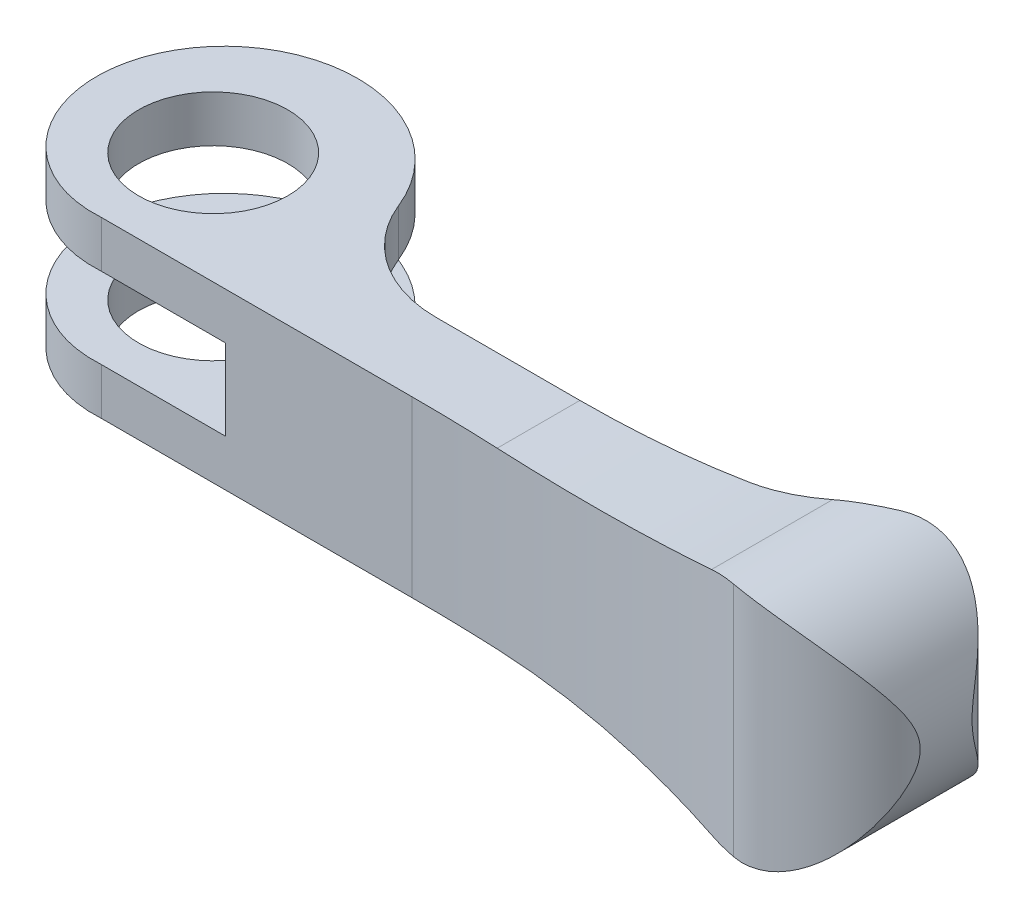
ISO-10303-21;
HEADER;
FILE_DESCRIPTION(('STEP AP214'),'2;1');
FILE_NAME('part.step','',(''),(''),'','','');
FILE_SCHEMA(('AUTOMOTIVE_DESIGN { 1 0 10303 214 1 1 1 1 }'));
ENDSEC;
DATA;
#1=APPLICATION_CONTEXT('core data for automotive mechanical design processes');
#2=APPLICATION_PROTOCOL_DEFINITION('international standard','automotive_design',2000,#1);
#3=PRODUCT_CONTEXT('',#1,'mechanical');
#4=PRODUCT('Part','Part','',(#3));
#5=PRODUCT_RELATED_PRODUCT_CATEGORY('part','',(#4));
#6=PRODUCT_DEFINITION_FORMATION('','',#4);
#7=PRODUCT_DEFINITION_CONTEXT('part definition',#1,'design');
#8=PRODUCT_DEFINITION('design','',#6,#7);
#9=PRODUCT_DEFINITION_SHAPE('','',#8);
#10=(LENGTH_UNIT() NAMED_UNIT(*) SI_UNIT(.MILLI.,.METRE.));
#11=(NAMED_UNIT(*) PLANE_ANGLE_UNIT() SI_UNIT($,.RADIAN.));
#12=(NAMED_UNIT(*) SI_UNIT($,.STERADIAN.) SOLID_ANGLE_UNIT());
#13=UNCERTAINTY_MEASURE_WITH_UNIT(LENGTH_MEASURE(1.E-05),#10,'distance_accuracy_value','');
#14=(GEOMETRIC_REPRESENTATION_CONTEXT(3) GLOBAL_UNCERTAINTY_ASSIGNED_CONTEXT((#13)) GLOBAL_UNIT_ASSIGNED_CONTEXT((#10,
#11,#12)) REPRESENTATION_CONTEXT('',''));
#15=CARTESIAN_POINT('',(0.,0.,0.));
#16=DIRECTION('',(0.,0.,1.));
#17=DIRECTION('',(1.,0.,0.));
#18=AXIS2_PLACEMENT_3D('',#15,#16,#17);
#19=CARTESIAN_POINT('',(25.,-9.5,165.511363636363));
#20=DIRECTION('',(0.,1.,0.));
#21=DIRECTION('',(1.,0.,0.));
#22=AXIS2_PLACEMENT_3D('',#19,#20,#21);
#23=CYLINDRICAL_SURFACE('',#22,156.511363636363);
#24=CARTESIAN_POINT('',(51.3201707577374,9.24653148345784,11.2289746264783));
#25=CARTESIAN_POINT('',(51.4954696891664,9.2878649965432,11.258877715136));
#26=CARTESIAN_POINT('',(51.6718456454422,9.32417702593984,11.2892762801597));
#27=CARTESIAN_POINT('',(52.0256660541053,9.38661054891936,11.3508882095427));
#28=CARTESIAN_POINT('',(52.203105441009,9.41276355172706,11.3820987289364));
#29=CARTESIAN_POINT('',(52.7374701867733,9.476153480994,11.4770445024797));
#30=CARTESIAN_POINT('',(53.0960294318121,9.49822441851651,11.5420236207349));
#31=CARTESIAN_POINT('',(53.4546518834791,9.49989176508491,11.608343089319));
#32=B_SPLINE_CURVE_WITH_KNOTS('',3,(#24,#25,#26,#27,#28,#29,#30,#31),.UNSPECIFIED.,.F.,.F.,(4,2,
2,4),(0.,0.547600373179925,1.0934884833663,2.18654613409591),.UNSPECIFIED.);
#33=CARTESIAN_POINT('',(51.3201707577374,9.24653148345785,11.2289746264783));
#34=VERTEX_POINT('',#33);
#35=CARTESIAN_POINT('',(53.4546518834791,9.49989176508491,11.6083430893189));
#36=VERTEX_POINT('',#35);
#37=EDGE_CURVE('E179',#34,#36,#32,.T.);
#38=ORIENTED_EDGE('',*,*,#37,.F.);
#39=CARTESIAN_POINT('',(32.,7.,9.15661651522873));
#40=CARTESIAN_POINT('',(32.8182704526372,6.99999719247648,9.19324583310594));
#41=CARTESIAN_POINT('',(33.6361960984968,7.01192923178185,9.23630636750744));
#42=CARTESIAN_POINT('',(35.2705716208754,7.05957160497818,9.33520563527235));
#43=CARTESIAN_POINT('',(36.0870215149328,7.09528165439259,9.39104421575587));
#44=CARTESIAN_POINT('',(38.5259507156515,7.23753055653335,9.57706397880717));
#45=CARTESIAN_POINT('',(40.1451052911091,7.37919060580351,9.72606814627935));
#46=CARTESIAN_POINT('',(43.3672677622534,7.75507082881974,10.0730278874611));
#47=CARTESIAN_POINT('',(44.9702760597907,7.98928869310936,10.2709822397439));
#48=CARTESIAN_POINT('',(47.3611114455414,8.40908803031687,10.6035220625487));
#49=CARTESIAN_POINT('',(48.1574841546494,8.56083603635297,10.7205953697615));
#50=CARTESIAN_POINT('',(49.7438041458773,8.88685979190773,10.9662394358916));
#51=CARTESIAN_POINT('',(50.5337515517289,9.06113510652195,11.0948099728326));
#52=CARTESIAN_POINT('',(51.3201707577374,9.24653148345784,11.2289746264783));
#53=B_SPLINE_CURVE_WITH_KNOTS('',3,(#39,#40,#41,#42,#43,#44,#45,#46,#47,#48,#49,#50,#51,#52),
.UNSPECIFIED.,.F.,.F.,(4,2,2,2,2,2,4),(0.,2.45704528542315,4.91406117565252,9.80682643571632,
14.699469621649,17.1564399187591,19.6133627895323),.UNSPECIFIED.);
#54=CARTESIAN_POINT('',(32.,7.,9.15661651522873));
#55=VERTEX_POINT('',#54);
#56=EDGE_CURVE('E145',#55,#34,#53,.T.);
#57=ORIENTED_EDGE('',*,*,#56,.F.);
#58=CARTESIAN_POINT('',(25.,7.,165.511363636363));
#59=DIRECTION('',(0.,1.,0.));
#60=DIRECTION('',(1.,0.,0.));
#61=AXIS2_PLACEMENT_3D('',#58,#59,#60);
#62=CIRCLE('',#61,156.511363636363);
#63=CARTESIAN_POINT('',(25.,7.,9.));
#64=VERTEX_POINT('',#63);
#65=EDGE_CURVE('E154',#64,#55,#62,.F.);
#66=ORIENTED_EDGE('',*,*,#65,.F.);
#67=DIRECTION('',(0.,1.,0.));
#68=VECTOR('',#67,1.);
#69=CARTESIAN_POINT('',(25.,-9.5,9.));
#70=LINE('',#69,#68);
#71=CARTESIAN_POINT('',(25.,-7.,9.));
#72=VERTEX_POINT('',#71);
#73=EDGE_CURVE('E303',#72,#64,#70,.T.);
#74=ORIENTED_EDGE('',*,*,#73,.F.);
#75=CARTESIAN_POINT('',(25.,-7.,165.511363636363));
#76=DIRECTION('',(0.,1.,0.));
#77=DIRECTION('',(1.,0.,0.));
#78=AXIS2_PLACEMENT_3D('',#75,#76,#77);
#79=CIRCLE('',#78,156.511363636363);
#80=CARTESIAN_POINT('',(32.,-7.,9.15661651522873));
#81=VERTEX_POINT('',#80);
#82=EDGE_CURVE('E558',#72,#81,#79,.F.);
#83=ORIENTED_EDGE('',*,*,#82,.T.);
#84=CARTESIAN_POINT('',(32.,-7.,9.15661651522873));
#85=CARTESIAN_POINT('',(32.8182704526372,-6.99999719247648,9.19324583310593));
#86=CARTESIAN_POINT('',(33.6361960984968,-7.01192923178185,9.23630636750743));
#87=CARTESIAN_POINT('',(35.2705716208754,-7.05957160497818,9.33520563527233));
#88=CARTESIAN_POINT('',(36.0870215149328,-7.09528165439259,9.39104421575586));
#89=CARTESIAN_POINT('',(38.5259507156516,-7.23753055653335,9.57706397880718));
#90=CARTESIAN_POINT('',(40.1451052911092,-7.37919060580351,9.72606814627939));
#91=CARTESIAN_POINT('',(43.3672677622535,-7.75507082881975,10.0730278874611));
#92=CARTESIAN_POINT('',(44.9702760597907,-7.98928869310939,10.2709822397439));
#93=CARTESIAN_POINT('',(47.3611114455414,-8.40908803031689,10.6035220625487));
#94=CARTESIAN_POINT('',(48.1574841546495,-8.56083603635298,10.7205953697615));
#95=CARTESIAN_POINT('',(49.7438041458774,-8.88685979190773,10.9662394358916));
#96=CARTESIAN_POINT('',(50.533751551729,-9.06113510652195,11.0948099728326));
#97=CARTESIAN_POINT('',(51.3201707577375,-9.24653148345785,11.2289746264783));
#98=B_SPLINE_CURVE_WITH_KNOTS('',3,(#84,#85,#86,#87,#88,#89,#90,#91,#92,#93,#94,#95,#96,#97),
.UNSPECIFIED.,.F.,.F.,(4,2,2,2,2,2,4),(0.,2.45704528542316,4.91406117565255,9.80682643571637,
14.699469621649,17.1564399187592,19.6133627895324),.UNSPECIFIED.);
#99=CARTESIAN_POINT('',(51.3201707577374,-9.24653148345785,11.2289746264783));
#100=VERTEX_POINT('',#99);
#101=EDGE_CURVE('E541',#81,#100,#98,.T.);
#102=ORIENTED_EDGE('',*,*,#101,.T.);
#103=CARTESIAN_POINT('',(51.3201707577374,-9.24653148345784,11.2289746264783));
#104=CARTESIAN_POINT('',(51.4954696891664,-9.2878649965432,11.258877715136));
#105=CARTESIAN_POINT('',(51.6718456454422,-9.32417702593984,11.2892762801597));
#106=CARTESIAN_POINT('',(52.0256660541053,-9.38661054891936,11.3508882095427));
#107=CARTESIAN_POINT('',(52.203105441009,-9.41276355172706,11.3820987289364));
#108=CARTESIAN_POINT('',(52.7374701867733,-9.476153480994,11.4770445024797));
#109=CARTESIAN_POINT('',(53.0960294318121,-9.49822441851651,11.5420236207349));
#110=CARTESIAN_POINT('',(53.4546518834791,-9.49989176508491,11.608343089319));
#111=B_SPLINE_CURVE_WITH_KNOTS('',3,(#103,#104,#105,#106,#107,#108,#109,#110),.UNSPECIFIED.,.F.,
.F.,(4,2,2,4),(0.,0.547600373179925,1.0934884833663,2.18654613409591),.UNSPECIFIED.);
#112=CARTESIAN_POINT('',(53.4546518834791,-9.49989176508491,11.6083430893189));
#113=VERTEX_POINT('',#112);
#114=EDGE_CURVE('E222',#100,#113,#111,.T.);
#115=ORIENTED_EDGE('',*,*,#114,.T.);
#116=DIRECTION('',(0.,1.,0.));
#117=VECTOR('',#116,1.);
#118=CARTESIAN_POINT('',(53.4546518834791,-9.5,11.6083430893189));
#119=LINE('',#118,#117);
#120=EDGE_CURVE('E286',#113,#36,#119,.T.);
#121=ORIENTED_EDGE('',*,*,#120,.T.);
#122=EDGE_LOOP('',(#38,#57,#66,#74,#83,#102,#115,#121));
#123=FACE_BOUND('',#122,.T.);
#124=ADVANCED_FACE('F14',(#123),#23,.F.);
#125=CARTESIAN_POINT('',(0.,-9.5,9.));
#126=DIRECTION('',(0.,0.,-1.));
#127=DIRECTION('',(1.,0.,0.));
#128=AXIS2_PLACEMENT_3D('',#125,#126,#127);
#129=PLANE('',#128);
#130=DIRECTION('',(1.,0.,0.));
#131=VECTOR('',#130,1.);
#132=CARTESIAN_POINT('',(0.,7.,9.));
#133=LINE('',#132,#131);
#134=CARTESIAN_POINT('',(0.,7.,9.));
#135=VERTEX_POINT('',#134);
#136=EDGE_CURVE('E164',#135,#64,#133,.T.);
#137=ORIENTED_EDGE('',*,*,#136,.F.);
#138=DIRECTION('',(0.,1.,0.));
#139=VECTOR('',#138,1.);
#140=CARTESIAN_POINT('',(0.,-9.5,9.));
#141=LINE('',#140,#139);
#142=CARTESIAN_POINT('',(0.,3.25,9.));
#143=VERTEX_POINT('',#142);
#144=EDGE_CURVE('E294',#143,#135,#141,.T.);
#145=ORIENTED_EDGE('',*,*,#144,.F.);
#146=DIRECTION('',(1.,0.,0.));
#147=VECTOR('',#146,1.);
#148=CARTESIAN_POINT('',(0.,3.25,9.));
#149=LINE('',#148,#147);
#150=CARTESIAN_POINT('',(10.,3.25,9.));
#151=VERTEX_POINT('',#150);
#152=EDGE_CURVE('E42',#143,#151,#149,.T.);
#153=ORIENTED_EDGE('',*,*,#152,.T.);
#154=DIRECTION('',(0.,-1.,0.));
#155=VECTOR('',#154,1.);
#156=CARTESIAN_POINT('',(10.,-9.5,9.));
#157=LINE('',#156,#155);
#158=CARTESIAN_POINT('',(10.,-3.25,9.));
#159=VERTEX_POINT('',#158);
#160=EDGE_CURVE('E367',#151,#159,#157,.T.);
#161=ORIENTED_EDGE('',*,*,#160,.T.);
#162=DIRECTION('',(-1.,0.,0.));
#163=VECTOR('',#162,1.);
#164=CARTESIAN_POINT('',(0.,-3.25,9.));
#165=LINE('',#164,#163);
#166=CARTESIAN_POINT('',(0.,-3.25,9.));
#167=VERTEX_POINT('',#166);
#168=EDGE_CURVE('E361',#159,#167,#165,.T.);
#169=ORIENTED_EDGE('',*,*,#168,.T.);
#170=CARTESIAN_POINT('',(0.,-7.,9.));
#171=VERTEX_POINT('',#170);
#172=EDGE_CURVE('E298',#171,#167,#141,.T.);
#173=ORIENTED_EDGE('',*,*,#172,.F.);
#174=DIRECTION('',(1.,0.,0.));
#175=VECTOR('',#174,1.);
#176=CARTESIAN_POINT('',(0.,-7.,9.));
#177=LINE('',#176,#175);
#178=EDGE_CURVE('E543',#171,#72,#177,.T.);
#179=ORIENTED_EDGE('',*,*,#178,.T.);
#180=ORIENTED_EDGE('',*,*,#73,.T.);
#181=EDGE_LOOP('',(#137,#145,#153,#161,#169,#173,#179,#180));
#182=FACE_BOUND('',#181,.T.);
#183=ADVANCED_FACE('F274',(#182),#129,.F.);
#184=CARTESIAN_POINT('',(0.,-9.5,9.));
#185=CARTESIAN_POINT('',(-1.17809724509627,-9.5,9.082375));
#186=CARTESIAN_POINT('',(-2.38889185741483,-9.5,8.93034251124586));
#187=CARTESIAN_POINT('',(-4.68855121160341,-9.5,8.15611653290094));
#188=CARTESIAN_POINT('',(-5.77641227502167,-9.5,7.53398899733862));
#189=CARTESIAN_POINT('',(-7.65048483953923,-9.5,5.892908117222));
#190=CARTESIAN_POINT('',(-8.43577630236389,-9.5,4.87441779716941));
#191=CARTESIAN_POINT('',(-9.56393765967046,-9.5,2.58130784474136));
#192=CARTESIAN_POINT('',(-9.906125,-9.5,1.3074915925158));
#193=CARTESIAN_POINT('',(-10.070875,-9.5,-1.30749159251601));
#194=CARTESIAN_POINT('',(-9.89311450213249,-9.5,-2.64762964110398));
#195=CARTESIAN_POINT('',(-9.01985437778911,-9.5,-5.18637857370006));
#196=CARTESIAN_POINT('',(-8.32445967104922,-9.5,-6.38389170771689));
#197=CARTESIAN_POINT('',(-6.50038754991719,-9.5,-8.44095551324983));
#198=CARTESIAN_POINT('',(-5.37224515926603,-9.5,-9.29951414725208));
#199=CARTESIAN_POINT('',(-2.8400456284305,-9.5,-10.5267096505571));
#200=CARTESIAN_POINT('',(-1.43688593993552,-9.5,-10.894625));
#201=CARTESIAN_POINT('',(1.43688593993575,-9.5,-11.059375));
#202=CARTESIAN_POINT('',(2.90636742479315,-9.5,-10.8558864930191));
#203=CARTESIAN_POINT('',(5.6842059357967,-9.5,-9.88359222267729));
#204=CARTESIAN_POINT('',(6.9913711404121,-9.5,-9.11493034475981));
#205=CARTESIAN_POINT('',(9.23142618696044,-9.5,-7.10786698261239));
#206=CARTESIAN_POINT('',(10.1632519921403,-9.5,-5.87007252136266));
#207=CARTESIAN_POINT('',(11.4894816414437,-9.5,-3.09878341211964));
#208=CARTESIAN_POINT('',(11.883125,-9.5,-1.56628028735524));
#209=CARTESIAN_POINT('',(12.047875,-9.5,1.56628028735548));
#210=CARTESIAN_POINT('',(11.8186584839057,-9.5,3.16510520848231));
#211=CARTESIAN_POINT('',(10.7473300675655,-9.5,6.18203329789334));
#212=CARTESIAN_POINT('',(9.9054010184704,-9.5,7.59885057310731));
#213=CARTESIAN_POINT('',(7.71534641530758,-9.5,10.021896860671));
#214=CARTESIAN_POINT('',(6.36789988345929,-9.5,11.0269898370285));
#215=CARTESIAN_POINT('',(3.35752119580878,-9.5,12.4522536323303));
#216=CARTESIAN_POINT('',(1.69567463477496,-9.5,12.871625));
#217=CARTESIAN_POINT('',(-1.32513132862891E-13,-9.5,12.954));
#218=B_SPLINE_CURVE_WITH_KNOTS('',3,(#184,#185,#186,#187,#188,#189,#190,#191,#192,#193,#194,
#195,#196,#197,#198,#199,#200,#201,#202,#203,#204,#205,#206,#207,#208,#209,#210,#211,#212,#213,
#214,#215,#216,#217),.UNSPECIFIED.,.F.,.F.,(4,2,2,2,2,2,2,2,2,2,2,2,2,2,2,2,4),(0.,0.0625,0.125,
0.1875,0.25,0.3125,0.375,0.4375,0.5,0.5625,0.625,0.6875,0.75,0.8125,0.875,0.9375,1.),.UNSPECIFIED.);
#219=DIRECTION('',(0.,1.,0.));
#220=VECTOR('',#219,1.);
#221=SURFACE_OF_LINEAR_EXTRUSION('',#218,#220);
#222=CARTESIAN_POINT('',(0.,7.,9.));
#223=CARTESIAN_POINT('',(-1.17809724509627,7.,9.082375));
#224=CARTESIAN_POINT('',(-2.38889185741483,7.,8.93034251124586));
#225=CARTESIAN_POINT('',(-4.68855121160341,7.,8.15611653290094));
#226=CARTESIAN_POINT('',(-5.77641227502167,7.,7.53398899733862));
#227=CARTESIAN_POINT('',(-7.65048483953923,7.,5.892908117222));
#228=CARTESIAN_POINT('',(-8.43577630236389,7.,4.87441779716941));
#229=CARTESIAN_POINT('',(-9.56393765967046,7.,2.58130784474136));
#230=CARTESIAN_POINT('',(-9.906125,7.,1.3074915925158));
#231=CARTESIAN_POINT('',(-10.070875,7.,-1.30749159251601));
#232=CARTESIAN_POINT('',(-9.89311450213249,7.,-2.64762964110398));
#233=CARTESIAN_POINT('',(-9.01985437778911,7.,-5.18637857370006));
#234=CARTESIAN_POINT('',(-8.32445967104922,7.,-6.38389170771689));
#235=CARTESIAN_POINT('',(-6.50038754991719,7.,-8.44095551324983));
#236=CARTESIAN_POINT('',(-5.37224515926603,7.,-9.29951414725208));
#237=CARTESIAN_POINT('',(-2.8400456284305,7.,-10.5267096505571));
#238=CARTESIAN_POINT('',(-1.43688593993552,7.,-10.894625));
#239=CARTESIAN_POINT('',(1.43688593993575,7.,-11.059375));
#240=CARTESIAN_POINT('',(2.90636742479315,7.,-10.8558864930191));
#241=CARTESIAN_POINT('',(5.6842059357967,7.,-9.88359222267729));
#242=CARTESIAN_POINT('',(6.9913711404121,7.,-9.11493034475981));
#243=CARTESIAN_POINT('',(9.23142618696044,7.,-7.10786698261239));
#244=CARTESIAN_POINT('',(10.1632519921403,7.,-5.87007252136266));
#245=CARTESIAN_POINT('',(11.4894816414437,7.,-3.09878341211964));
#246=CARTESIAN_POINT('',(11.883125,7.,-1.56628028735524));
#247=CARTESIAN_POINT('',(12.047875,7.,1.56628028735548));
#248=CARTESIAN_POINT('',(11.8186584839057,7.,3.16510520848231));
#249=CARTESIAN_POINT('',(10.7473300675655,7.,6.18203329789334));
#250=CARTESIAN_POINT('',(9.9054010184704,7.,7.59885057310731));
#251=CARTESIAN_POINT('',(7.71534641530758,7.,10.021896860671));
#252=CARTESIAN_POINT('',(6.36789988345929,7.,11.0269898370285));
#253=CARTESIAN_POINT('',(3.35752119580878,7.,12.4522536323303));
#254=CARTESIAN_POINT('',(1.69567463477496,7.,12.871625));
#255=CARTESIAN_POINT('',(-1.32513132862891E-13,7.,12.954));
#256=B_SPLINE_CURVE_WITH_KNOTS('',3,(#222,#223,#224,#225,#226,#227,#228,#229,#230,#231,#232,
#233,#234,#235,#236,#237,#238,#239,#240,#241,#242,#243,#244,#245,#246,#247,#248,#249,#250,#251,
#252,#253,#254,#255),.UNSPECIFIED.,.F.,.F.,(4,2,2,2,2,2,2,2,2,2,2,2,2,2,2,2,4),(0.,0.0625,0.125,
0.1875,0.25,0.3125,0.375,0.4375,0.5,0.5625,0.625,0.6875,0.75,0.8125,0.875,0.9375,1.),.UNSPECIFIED.);
#257=CARTESIAN_POINT('',(11.1333903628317,7.,-3.78460278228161));
#258=VERTEX_POINT('',#257);
#259=EDGE_CURVE('E162',#258,#135,#256,.F.);
#260=ORIENTED_EDGE('',*,*,#259,.F.);
#261=DIRECTION('',(0.,1.,0.));
#262=VECTOR('',#261,1.);
#263=CARTESIAN_POINT('',(11.1333903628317,9.5,-3.78460278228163));
#264=LINE('',#263,#262);
#265=CARTESIAN_POINT('',(11.1333903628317,3.25,-3.78460278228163));
#266=VERTEX_POINT('',#265);
#267=EDGE_CURVE('E35',#258,#266,#264,.F.);
#268=ORIENTED_EDGE('',*,*,#267,.T.);
#269=CARTESIAN_POINT('',(0.,3.25,9.));
#270=CARTESIAN_POINT('',(-1.17809724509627,3.25,9.082375));
#271=CARTESIAN_POINT('',(-2.38889185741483,3.25,8.93034251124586));
#272=CARTESIAN_POINT('',(-4.68855121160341,3.25,8.15611653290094));
#273=CARTESIAN_POINT('',(-5.77641227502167,3.25,7.53398899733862));
#274=CARTESIAN_POINT('',(-7.65048483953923,3.25,5.892908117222));
#275=CARTESIAN_POINT('',(-8.43577630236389,3.25,4.87441779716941));
#276=CARTESIAN_POINT('',(-9.56393765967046,3.25,2.58130784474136));
#277=CARTESIAN_POINT('',(-9.906125,3.25,1.3074915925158));
#278=CARTESIAN_POINT('',(-10.070875,3.25,-1.30749159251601));
#279=CARTESIAN_POINT('',(-9.89311450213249,3.25,-2.64762964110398));
#280=CARTESIAN_POINT('',(-9.01985437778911,3.25,-5.18637857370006));
#281=CARTESIAN_POINT('',(-8.32445967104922,3.25,-6.38389170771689));
#282=CARTESIAN_POINT('',(-6.50038754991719,3.25,-8.44095551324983));
#283=CARTESIAN_POINT('',(-5.37224515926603,3.25,-9.29951414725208));
#284=CARTESIAN_POINT('',(-2.8400456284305,3.25,-10.5267096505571));
#285=CARTESIAN_POINT('',(-1.43688593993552,3.25,-10.894625));
#286=CARTESIAN_POINT('',(1.43688593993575,3.25,-11.059375));
#287=CARTESIAN_POINT('',(2.90636742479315,3.25,-10.8558864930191));
#288=CARTESIAN_POINT('',(5.6842059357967,3.25,-9.88359222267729));
#289=CARTESIAN_POINT('',(6.9913711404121,3.25,-9.11493034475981));
#290=CARTESIAN_POINT('',(9.23142618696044,3.25,-7.10786698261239));
#291=CARTESIAN_POINT('',(10.1632519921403,3.25,-5.87007252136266));
#292=CARTESIAN_POINT('',(11.4894816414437,3.25,-3.09878341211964));
#293=CARTESIAN_POINT('',(11.883125,3.25,-1.56628028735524));
#294=CARTESIAN_POINT('',(12.047875,3.25,1.56628028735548));
#295=CARTESIAN_POINT('',(11.8186584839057,3.25,3.16510520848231));
#296=CARTESIAN_POINT('',(10.7473300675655,3.25,6.18203329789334));
#297=CARTESIAN_POINT('',(9.9054010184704,3.25,7.59885057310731));
#298=CARTESIAN_POINT('',(7.71534641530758,3.25,10.021896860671));
#299=CARTESIAN_POINT('',(6.36789988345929,3.25,11.0269898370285));
#300=CARTESIAN_POINT('',(3.35752119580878,3.25,12.4522536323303));
#301=CARTESIAN_POINT('',(1.69567463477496,3.25,12.871625));
#302=CARTESIAN_POINT('',(-1.32513132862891E-13,3.25,12.954));
#303=B_SPLINE_CURVE_WITH_KNOTS('',3,(#269,#270,#271,#272,#273,#274,#275,#276,#277,#278,#279,
#280,#281,#282,#283,#284,#285,#286,#287,#288,#289,#290,#291,#292,#293,#294,#295,#296,#297,#298,
#299,#300,#301,#302),.UNSPECIFIED.,.F.,.F.,(4,2,2,2,2,2,2,2,2,2,2,2,2,2,2,2,4),(0.,0.0625,0.125,
0.1875,0.25,0.3125,0.375,0.4375,0.5,0.5625,0.625,0.6875,0.75,0.8125,0.875,0.9375,1.),.UNSPECIFIED.);
#304=EDGE_CURVE('E309',#266,#143,#303,.F.);
#305=ORIENTED_EDGE('',*,*,#304,.T.);
#306=ORIENTED_EDGE('',*,*,#144,.T.);
#307=EDGE_LOOP('',(#260,#268,#305,#306));
#308=FACE_BOUND('',#307,.T.);
#309=ADVANCED_FACE('F280',(#308),#221,.F.);
#310=CARTESIAN_POINT('',(11.8345872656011,-9.5,2.5));
#311=DIRECTION('',(0.,0.,1.));
#312=DIRECTION('',(-1.,0.,0.));
#313=AXIS2_PLACEMENT_3D('',#310,#311,#312);
#314=PLANE('',#313);
#315=CARTESIAN_POINT('',(32.,91.2,2.5));
#316=DIRECTION('',(0.,0.,1.));
#317=DIRECTION('',(-1.,0.,0.));
#318=AXIS2_PLACEMENT_3D('',#315,#316,#317);
#319=CIRCLE('',#318,84.2);
#320=CARTESIAN_POINT('',(45.5626570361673,8.09949257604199,2.5));
#321=VERTEX_POINT('',#320);
#322=CARTESIAN_POINT('',(32.,7.,2.5));
#323=VERTEX_POINT('',#322);
#324=EDGE_CURVE('E134',#321,#323,#319,.F.);
#325=ORIENTED_EDGE('',*,*,#324,.F.);
#326=DIRECTION('',(0.,1.,0.));
#327=VECTOR('',#326,1.);
#328=CARTESIAN_POINT('',(45.5626570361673,-9.5,2.5));
#329=LINE('',#328,#327);
#330=CARTESIAN_POINT('',(45.5626570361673,-8.09949257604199,2.5));
#331=VERTEX_POINT('',#330);
#332=EDGE_CURVE('E290',#331,#321,#329,.T.);
#333=ORIENTED_EDGE('',*,*,#332,.F.);
#334=CARTESIAN_POINT('',(32.,-91.2,2.5));
#335=DIRECTION('',(0.,0.,1.));
#336=DIRECTION('',(-1.,0.,0.));
#337=AXIS2_PLACEMENT_3D('',#334,#335,#336);
#338=CIRCLE('',#337,84.2);
#339=CARTESIAN_POINT('',(32.,-7.,2.5));
#340=VERTEX_POINT('',#339);
#341=EDGE_CURVE('E257',#331,#340,#338,.T.);
#342=ORIENTED_EDGE('',*,*,#341,.T.);
#343=DIRECTION('',(-1.,0.,0.));
#344=VECTOR('',#343,1.);
#345=CARTESIAN_POINT('',(11.8345872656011,-7.,2.5));
#346=LINE('',#345,#344);
#347=CARTESIAN_POINT('',(20.417560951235,-7.,2.5));
#348=VERTEX_POINT('',#347);
#349=EDGE_CURVE('E330',#340,#348,#346,.T.);
#350=ORIENTED_EDGE('',*,*,#349,.T.);
#351=DIRECTION('',(0.,-1.,0.));
#352=VECTOR('',#351,1.);
#353=CARTESIAN_POINT('',(20.417560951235,9.5,2.5));
#354=LINE('',#353,#352);
#355=CARTESIAN_POINT('',(20.417560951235,-3.25,2.5));
#356=VERTEX_POINT('',#355);
#357=EDGE_CURVE('E315',#348,#356,#354,.F.);
#358=ORIENTED_EDGE('',*,*,#357,.T.);
#359=DIRECTION('',(-1.,0.,0.));
#360=VECTOR('',#359,1.);
#361=CARTESIAN_POINT('',(28.,-3.25,2.5));
#362=LINE('',#361,#360);
#363=CARTESIAN_POINT('',(10.,-3.25,2.5));
#364=VERTEX_POINT('',#363);
#365=EDGE_CURVE('E341',#356,#364,#362,.T.);
#366=ORIENTED_EDGE('',*,*,#365,.T.);
#367=DIRECTION('',(0.,1.,0.));
#368=VECTOR('',#367,1.);
#369=CARTESIAN_POINT('',(10.,-3.25,2.5));
#370=LINE('',#369,#368);
#371=CARTESIAN_POINT('',(10.,3.25,2.5));
#372=VERTEX_POINT('',#371);
#373=EDGE_CURVE('E339',#364,#372,#370,.T.);
#374=ORIENTED_EDGE('',*,*,#373,.T.);
#375=DIRECTION('',(-1.,0.,0.));
#376=VECTOR('',#375,1.);
#377=CARTESIAN_POINT('',(28.,3.25,2.5));
#378=LINE('',#377,#376);
#379=CARTESIAN_POINT('',(20.417560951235,3.25,2.5));
#380=VERTEX_POINT('',#379);
#381=EDGE_CURVE('E336',#380,#372,#378,.T.);
#382=ORIENTED_EDGE('',*,*,#381,.F.);
#383=CARTESIAN_POINT('',(20.417560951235,7.,2.50000000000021));
#384=VERTEX_POINT('',#383);
#385=EDGE_CURVE('E161',#380,#384,#354,.F.);
#386=ORIENTED_EDGE('',*,*,#385,.T.);
#387=DIRECTION('',(-1.,0.,0.));
#388=VECTOR('',#387,1.);
#389=CARTESIAN_POINT('',(11.8345872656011,7.,2.5));
#390=LINE('',#389,#388);
#391=EDGE_CURVE('E151',#323,#384,#390,.T.);
#392=ORIENTED_EDGE('',*,*,#391,.F.);
#393=EDGE_LOOP('',(#325,#333,#342,#350,#358,#366,#374,#382,#386,#392));
#394=FACE_BOUND('',#393,.T.);
#395=ADVANCED_FACE('F158',(#394),#314,.F.);
#396=CARTESIAN_POINT('',(45.5626570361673,-9.5,-14.5));
#397=DIRECTION('',(0.,1.,0.));
#398=DIRECTION('',(1.,0.,0.));
#399=AXIS2_PLACEMENT_3D('',#396,#397,#398);
#400=CYLINDRICAL_SURFACE('',#399,17.);
#401=CARTESIAN_POINT('',(54.9597606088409,9.38717736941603,-0.333333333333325));
#402=CARTESIAN_POINT('',(54.7316206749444,9.42267662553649,-0.181950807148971));
#403=CARTESIAN_POINT('',(54.498837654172,9.45033434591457,-0.0355271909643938));
#404=CARTESIAN_POINT('',(54.0250539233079,9.48845532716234,0.246646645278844));
#405=CARTESIAN_POINT('',(53.7840411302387,9.49889208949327,0.382380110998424));
#406=CARTESIAN_POINT('',(53.3000815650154,9.5009221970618,0.639552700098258));
#407=CARTESIAN_POINT('',(53.0572524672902,9.49285956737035,0.761209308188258));
#408=CARTESIAN_POINT('',(52.5674007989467,9.45729667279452,0.992150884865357));
#409=CARTESIAN_POINT('',(52.3203826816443,9.42981592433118,1.10144814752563));
#410=CARTESIAN_POINT('',(51.9475951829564,9.37315159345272,1.2559775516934));
#411=CARTESIAN_POINT('',(51.8226148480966,9.35161024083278,1.306040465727));
#412=CARTESIAN_POINT('',(51.5718111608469,9.30314348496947,1.40308902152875));
#413=CARTESIAN_POINT('',(51.4459865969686,9.27619341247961,1.45005920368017));
#414=CARTESIAN_POINT('',(51.3201707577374,9.24653148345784,1.49534418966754));
#415=B_SPLINE_CURVE_WITH_KNOTS('',3,(#401,#402,#403,#404,#405,#406,#407,#408,#409,#410,#411,
#412,#413,#414),.UNSPECIFIED.,.F.,.F.,(4,2,2,2,2,2,4),(0.,0.828239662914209,1.65775258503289,
2.47196473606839,3.28535971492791,3.6942751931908,4.10509995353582),.UNSPECIFIED.);
#416=CARTESIAN_POINT('',(54.9597606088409,9.38717736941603,-0.333333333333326));
#417=VERTEX_POINT('',#416);
#418=CARTESIAN_POINT('',(51.3201707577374,9.24653148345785,1.49534418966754));
#419=VERTEX_POINT('',#418);
#420=EDGE_CURVE('E146',#417,#419,#415,.T.);
#421=ORIENTED_EDGE('',*,*,#420,.F.);
#422=DIRECTION('',(0.,1.,0.));
#423=VECTOR('',#422,1.);
#424=CARTESIAN_POINT('',(54.9597606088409,-9.5,-0.333333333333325));
#425=LINE('',#424,#423);
#426=CARTESIAN_POINT('',(54.9597606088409,-9.38717736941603,-0.333333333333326));
#427=VERTEX_POINT('',#426);
#428=EDGE_CURVE('E295',#427,#417,#425,.T.);
#429=ORIENTED_EDGE('',*,*,#428,.F.);
#430=CARTESIAN_POINT('',(54.9597606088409,-9.38717736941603,-0.333333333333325));
#431=CARTESIAN_POINT('',(54.7316206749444,-9.42267662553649,-0.181950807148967));
#432=CARTESIAN_POINT('',(54.498837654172,-9.45033434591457,-0.0355271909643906));
#433=CARTESIAN_POINT('',(54.0250539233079,-9.48845532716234,0.246646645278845));
#434=CARTESIAN_POINT('',(53.7840411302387,-9.49889208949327,0.382380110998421));
#435=CARTESIAN_POINT('',(53.3000815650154,-9.5009221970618,0.639552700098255));
#436=CARTESIAN_POINT('',(53.0572524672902,-9.49285956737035,0.761209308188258));
#437=CARTESIAN_POINT('',(52.5674007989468,-9.45729667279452,0.992150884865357));
#438=CARTESIAN_POINT('',(52.3203826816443,-9.42981592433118,1.10144814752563));
#439=CARTESIAN_POINT('',(51.9475951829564,-9.37315159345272,1.2559775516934));
#440=CARTESIAN_POINT('',(51.8226148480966,-9.35161024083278,1.306040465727));
#441=CARTESIAN_POINT('',(51.5718111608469,-9.30314348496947,1.40308902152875));
#442=CARTESIAN_POINT('',(51.4459865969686,-9.27619341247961,1.45005920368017));
#443=CARTESIAN_POINT('',(51.3201707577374,-9.24653148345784,1.49534418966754));
#444=B_SPLINE_CURVE_WITH_KNOTS('',3,(#430,#431,#432,#433,#434,#435,#436,#437,#438,#439,#440,
#441,#442,#443),.UNSPECIFIED.,.F.,.F.,(4,2,2,2,2,2,4),(0.,0.82823966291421,1.65775258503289,
2.47196473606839,3.28535971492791,3.6942751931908,4.10509995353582),.UNSPECIFIED.);
#445=CARTESIAN_POINT('',(51.3201707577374,-9.24653148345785,1.49534418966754));
#446=VERTEX_POINT('',#445);
#447=EDGE_CURVE('E223',#427,#446,#444,.T.);
#448=ORIENTED_EDGE('',*,*,#447,.T.);
#449=CARTESIAN_POINT('',(51.3201707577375,-9.24653148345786,1.49534418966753));
#450=CARTESIAN_POINT('',(50.8603357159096,-9.13808848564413,1.66090351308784));
#451=CARTESIAN_POINT('',(50.3928479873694,-9.03200341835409,1.80673339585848));
#452=CARTESIAN_POINT('',(49.4492987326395,-8.82651076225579,2.05687636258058));
#453=CARTESIAN_POINT('',(48.9733251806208,-8.72705992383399,2.16148595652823));
#454=CARTESIAN_POINT('',(48.0126814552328,-8.53516921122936,2.32959170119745));
#455=CARTESIAN_POINT('',(47.5280109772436,-8.44272958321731,2.39308640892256));
#456=CARTESIAN_POINT('',(46.7955018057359,-8.30973871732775,2.45702873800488));
#457=CARTESIAN_POINT('',(46.5494786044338,-8.26620019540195,2.4731270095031));
#458=CARTESIAN_POINT('',(46.0565939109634,-8.18123846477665,2.49461289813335));
#459=CARTESIAN_POINT('',(45.8097323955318,-8.13981531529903,2.500000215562));
#460=CARTESIAN_POINT('',(45.5626570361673,-8.09949257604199,2.5));
#461=B_SPLINE_CURVE_WITH_KNOTS('',3,(#449,#450,#451,#452,#453,#454,#455,#456,#457,#458,#459,
#460),.UNSPECIFIED.,.F.,.F.,(4,2,2,2,2,4),(0.,1.5013779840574,2.99174983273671,4.48217398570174,
5.23305850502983,5.98396403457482),.UNSPECIFIED.);
#462=EDGE_CURVE('E292',#446,#331,#461,.T.);
#463=ORIENTED_EDGE('',*,*,#462,.T.);
#464=ORIENTED_EDGE('',*,*,#332,.T.);
#465=CARTESIAN_POINT('',(51.3201707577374,9.24653148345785,1.49534418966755));
#466=CARTESIAN_POINT('',(50.8603357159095,9.13808848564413,1.66090351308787));
#467=CARTESIAN_POINT('',(50.3928479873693,9.03200341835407,1.8067333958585));
#468=CARTESIAN_POINT('',(49.4492987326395,8.82651076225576,2.0568763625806));
#469=CARTESIAN_POINT('',(48.9733251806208,8.72705992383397,2.16148595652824));
#470=CARTESIAN_POINT('',(48.0126814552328,8.53516921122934,2.32959170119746));
#471=CARTESIAN_POINT('',(47.5280109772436,8.44272958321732,2.39308640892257));
#472=CARTESIAN_POINT('',(46.7955018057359,8.30973871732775,2.45702873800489));
#473=CARTESIAN_POINT('',(46.5494786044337,8.26620019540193,2.4731270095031));
#474=CARTESIAN_POINT('',(46.0565939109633,8.18123846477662,2.49461289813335));
#475=CARTESIAN_POINT('',(45.8097323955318,8.13981531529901,2.50000021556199));
#476=CARTESIAN_POINT('',(45.5626570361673,8.09949257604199,2.5));
#477=B_SPLINE_CURVE_WITH_KNOTS('',3,(#465,#466,#467,#468,#469,#470,#471,#472,#473,#474,#475,
#476),.UNSPECIFIED.,.F.,.F.,(4,2,2,2,2,4),(0.,1.50137798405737,2.99174983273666,
4.48217398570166,5.23305850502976,5.98396403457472),.UNSPECIFIED.);
#478=EDGE_CURVE('E9',#419,#321,#477,.T.);
#479=ORIENTED_EDGE('',*,*,#478,.F.);
#480=EDGE_LOOP('',(#421,#429,#448,#463,#464,#479));
#481=FACE_BOUND('',#480,.T.);
#482=ADVANCED_FACE('F190',(#481),#400,.F.);
#483=CARTESIAN_POINT('',(58.,-9.5,4.25));
#484=DIRECTION('',(0.,1.,0.));
#485=DIRECTION('',(1.,0.,0.));
#486=AXIS2_PLACEMENT_3D('',#483,#484,#485);
#487=CYLINDRICAL_SURFACE('',#486,5.5);
#488=ORIENTED_EDGE('',*,*,#428,.T.);
#489=CARTESIAN_POINT('',(54.9597606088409,9.38717736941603,-0.333333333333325));
#490=CARTESIAN_POINT('',(55.0773672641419,9.36890920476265,-0.411379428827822));
#491=CARTESIAN_POINT('',(55.1977181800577,9.34791104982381,-0.484658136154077));
#492=CARTESIAN_POINT('',(55.4427584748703,9.30006282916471,-0.621356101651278));
#493=CARTESIAN_POINT('',(55.5674473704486,9.27321341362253,-0.684776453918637));
#494=CARTESIAN_POINT('',(55.8194893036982,9.21339759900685,-0.801196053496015));
#495=CARTESIAN_POINT('',(55.9468283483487,9.18045839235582,-0.854239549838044));
#496=CARTESIAN_POINT('',(56.2035022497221,9.10817454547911,-0.95013066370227));
#497=CARTESIAN_POINT('',(56.3328370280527,9.06883015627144,-0.992978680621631));
#498=CARTESIAN_POINT('',(56.5923414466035,8.98365610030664,-1.06853033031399));
#499=CARTESIAN_POINT('',(56.7225111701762,8.93782577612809,-1.10123293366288));
#500=CARTESIAN_POINT('',(56.9825914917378,8.83973306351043,-1.15671511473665));
#501=CARTESIAN_POINT('',(57.1125019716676,8.78746822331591,-1.17949089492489));
#502=CARTESIAN_POINT('',(57.3709755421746,8.67671123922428,-1.21546938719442));
#503=CARTESIAN_POINT('',(57.4995386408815,8.61821913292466,-1.22867215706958));
#504=CARTESIAN_POINT('',(57.7544514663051,8.49527400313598,-1.24600183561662));
#505=CARTESIAN_POINT('',(57.8808003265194,8.43081870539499,-1.2501252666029));
#506=CARTESIAN_POINT('',(58.1354029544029,8.29365764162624,-1.24986389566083));
#507=CARTESIAN_POINT('',(58.2635348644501,8.22072656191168,-1.24513662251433));
#508=CARTESIAN_POINT('',(58.5158521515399,8.06925777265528,-1.22721754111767));
#509=CARTESIAN_POINT('',(58.6400360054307,7.99071793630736,-1.21402250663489));
#510=CARTESIAN_POINT('',(59.0058665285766,7.74732609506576,-1.16283883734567));
#511=CARTESIAN_POINT('',(59.2408364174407,7.57467783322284,-1.11325109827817));
#512=CARTESIAN_POINT('',(59.6405049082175,7.25224475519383,-1.00279535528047));
#513=CARTESIAN_POINT('',(59.8093120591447,7.10575174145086,-0.946787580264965));
#514=CARTESIAN_POINT('',(60.1338203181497,6.80378902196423,-0.822180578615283));
#515=CARTESIAN_POINT('',(60.289515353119,6.64831521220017,-0.753575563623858));
#516=CARTESIAN_POINT('',(60.7371745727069,6.16963779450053,-0.532140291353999));
#517=CARTESIAN_POINT('',(61.0091468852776,5.83464136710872,-0.363861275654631));
#518=CARTESIAN_POINT('',(61.4235163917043,5.24914542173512,-0.0596940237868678));
#519=CARTESIAN_POINT('',(61.579867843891,5.00488750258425,0.0699222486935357));
#520=CARTESIAN_POINT('',(61.8685709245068,4.5055731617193,0.335588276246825));
#521=CARTESIAN_POINT('',(62.0009048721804,4.25050895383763,0.471642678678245));
#522=CARTESIAN_POINT('',(62.2419737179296,3.72966259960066,0.744474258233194));
#523=CARTESIAN_POINT('',(62.3506994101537,3.46387631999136,0.881251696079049));
#524=CARTESIAN_POINT('',(62.4960478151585,3.05644242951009,1.0810294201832));
#525=CARTESIAN_POINT('',(62.5415283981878,2.9192192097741,1.14670294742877));
#526=CARTESIAN_POINT('',(62.6265277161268,2.64151248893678,1.27491345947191));
#527=CARTESIAN_POINT('',(62.6660477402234,2.50102970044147,1.33745112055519));
#528=CARTESIAN_POINT('',(62.7372492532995,2.22323842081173,1.45483334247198));
#529=CARTESIAN_POINT('',(62.7692149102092,2.0860986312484,1.50990265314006));
#530=CARTESIAN_POINT('',(62.8273897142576,1.80829431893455,1.6137435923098));
#531=CARTESIAN_POINT('',(62.8536014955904,1.66763144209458,1.6625180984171));
#532=CARTESIAN_POINT('',(62.8998518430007,1.3832681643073,1.75121136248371));
#533=CARTESIAN_POINT('',(62.919919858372,1.23958589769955,1.79117210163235));
#534=CARTESIAN_POINT('',(62.9536251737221,0.948860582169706,1.8597961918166));
#535=CARTESIAN_POINT('',(62.9672684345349,0.801820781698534,1.88847001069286));
#536=CARTESIAN_POINT('',(62.9849433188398,0.545508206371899,1.92607112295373));
#537=CARTESIAN_POINT('',(62.9905789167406,0.436822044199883,1.93824615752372));
#538=CARTESIAN_POINT('',(62.9981073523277,0.218764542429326,1.95456960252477));
#539=CARTESIAN_POINT('',(63.0000019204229,0.109393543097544,1.95872172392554));
#540=CARTESIAN_POINT('',(62.9999971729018,-0.161040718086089,1.95869806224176));
#541=CARTESIAN_POINT('',(62.9958843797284,-0.322130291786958,1.94966497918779));
#542=CARTESIAN_POINT('',(62.979631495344,-0.642129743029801,1.9147031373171));
#543=CARTESIAN_POINT('',(62.9674826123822,-0.801037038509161,1.888755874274));
#544=CARTESIAN_POINT('',(62.9355349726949,-1.11623389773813,1.82269084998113));
#545=CARTESIAN_POINT('',(62.9156805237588,-1.27249555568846,1.78247011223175));
#546=CARTESIAN_POINT('',(62.8688685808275,-1.58069825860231,1.69133860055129));
#547=CARTESIAN_POINT('',(62.8419105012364,-1.73263894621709,1.6404269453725));
#548=CARTESIAN_POINT('',(62.7611221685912,-2.13228410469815,1.49455458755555));
#549=CARTESIAN_POINT('',(62.7013579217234,-2.37630873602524,1.39285373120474));
#550=CARTESIAN_POINT('',(62.5643995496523,-2.8545711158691,1.17876211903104));
#551=CARTESIAN_POINT('',(62.4871914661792,-3.08880084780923,1.06636284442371));
#552=CARTESIAN_POINT('',(62.315575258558,-3.54908261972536,0.83732772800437));
#553=CARTESIAN_POINT('',(62.2211478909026,-3.77512516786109,0.720687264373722));
#554=CARTESIAN_POINT('',(62.0150908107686,-4.21937765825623,0.487922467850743));
#555=CARTESIAN_POINT('',(61.9034670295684,-4.43759026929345,0.371797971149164));
#556=CARTESIAN_POINT('',(61.6504966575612,-4.88801435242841,0.132083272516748));
#557=CARTESIAN_POINT('',(61.5072870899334,-5.11941519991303,0.00892283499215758));
#558=CARTESIAN_POINT('',(61.1989625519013,-5.57234434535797,-0.22822417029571));
#559=CARTESIAN_POINT('',(61.033839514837,-5.79386896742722,-0.342207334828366));
#560=CARTESIAN_POINT('',(60.6818932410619,-6.22475035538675,-0.556218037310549));
#561=CARTESIAN_POINT('',(60.4951499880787,-6.43414792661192,-0.656294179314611));
#562=CARTESIAN_POINT('',(60.0994626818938,-6.83937860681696,-0.838181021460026));
#563=CARTESIAN_POINT('',(59.8905394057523,-7.03522413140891,-0.920008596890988));
#564=CARTESIAN_POINT('',(59.5457605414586,-7.32979660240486,-1.02995144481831));
#565=CARTESIAN_POINT('',(59.4171203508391,-7.43406962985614,-1.0660323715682));
#566=CARTESIAN_POINT('',(59.1532071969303,-7.63668086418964,-1.12945341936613));
#567=CARTESIAN_POINT('',(59.0179364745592,-7.73502105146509,-1.15679647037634));
#568=CARTESIAN_POINT('',(58.7413217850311,-7.9250671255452,-1.20161088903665));
#569=CARTESIAN_POINT('',(58.5999810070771,-8.01677642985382,-1.21908737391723));
#570=CARTESIAN_POINT('',(58.3119067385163,-8.19292687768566,-1.24305022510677));
#571=CARTESIAN_POINT('',(58.1651731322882,-8.2773678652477,-1.24953635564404));
#572=CARTESIAN_POINT('',(57.8658401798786,-8.43911505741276,-1.2504200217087));
#573=CARTESIAN_POINT('',(57.7131965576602,-8.51634058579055,-1.24469479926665));
#574=CARTESIAN_POINT('',(57.4048258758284,-8.66206771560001,-1.21988980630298));
#575=CARTESIAN_POINT('',(57.2490986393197,-8.73056881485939,-1.20080926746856));
#576=CARTESIAN_POINT('',(56.9363620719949,-8.85832411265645,-1.14849703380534));
#577=CARTESIAN_POINT('',(56.7793539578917,-8.91758620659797,-1.11527751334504));
#578=CARTESIAN_POINT('',(56.4659305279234,-9.02667253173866,-1.03420803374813));
#579=CARTESIAN_POINT('',(56.3095150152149,-9.07650022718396,-0.986363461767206));
#580=CARTESIAN_POINT('',(55.947591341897,-9.18180315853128,-0.857411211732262));
#581=CARTESIAN_POINT('',(55.7430238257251,-9.2336618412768,-0.770533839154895));
#582=CARTESIAN_POINT('',(55.4433068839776,-9.29968394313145,-0.620921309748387));
#583=CARTESIAN_POINT('',(55.3445126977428,-9.31974185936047,-0.567783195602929));
#584=CARTESIAN_POINT('',(55.1498284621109,-9.35616721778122,-0.455226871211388));
#585=CARTESIAN_POINT('',(55.0539391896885,-9.37253368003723,-0.395806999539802));
#586=CARTESIAN_POINT('',(54.9597606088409,-9.38717736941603,-0.333333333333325));
#587=B_SPLINE_CURVE_WITH_KNOTS('',3,(#489,#490,#491,#492,#493,#494,#495,#496,#497,#498,#499,
#500,#501,#502,#503,#504,#505,#506,#507,#508,#509,#510,#511,#512,#513,#514,#515,#516,#517,#518,
#519,#520,#521,#522,#523,#524,#525,#526,#527,#528,#529,#530,#531,#532,#533,#534,#535,#536,#537,
#538,#539,#540,#541,#542,#543,#544,#545,#546,#547,#548,#549,#550,#551,#552,#553,#554,#555,#556,
#557,#558,#559,#560,#561,#562,#563,#564,#565,#566,#567,#568,#569,#570,#571,#572,#573,#574,#575,
#576,#577,#578,#579,#580,#581,#582,#583,#584,#585,#586),.UNSPECIFIED.,.F.,.F.,(4,2,2,2,2,2,2,2,
2,2,2,2,2,2,2,2,2,2,2,2,2,2,2,2,2,2,2,2,2,2,2,2,2,2,2,2,2,2,2,2,2,2,2,2,2,2,2,2,4),(0.,
0.426849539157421,0.853651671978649,1.27859214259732,1.70351596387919,2.12848288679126,
2.55361223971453,2.97873902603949,3.40402862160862,3.84611534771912,4.28837060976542,
5.17273156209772,5.86310747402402,6.5538014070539,7.93741520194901,8.88939991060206,
9.8420826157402,10.7951361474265,11.2713458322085,11.7474523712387,12.2008264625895,
12.6539925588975,13.1049511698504,13.5554905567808,13.8836900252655,14.2117376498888,
14.6946640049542,15.1781195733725,15.665136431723,16.1521934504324,16.9639239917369,
17.7763063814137,18.5896022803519,19.4026182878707,20.2977089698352,21.1931300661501,
22.0853384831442,22.9767183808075,23.4847665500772,23.9926441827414,24.5002581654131,
25.0078830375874,25.520634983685,26.0334164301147,26.5457572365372,27.0579095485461,
27.7400838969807,28.0817283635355,28.4234634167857),.UNSPECIFIED.);
#588=EDGE_CURVE('E250',#417,#427,#587,.T.);
#589=ORIENTED_EDGE('',*,*,#588,.T.);
#590=EDGE_LOOP('',(#488,#589));
#591=FACE_BOUND('',#590,.T.);
#592=ADVANCED_FACE('F259',(#591),#487,.T.);
#593=CARTESIAN_POINT('',(55.,-9.5,3.25));
#594=DIRECTION('',(0.,1.,0.));
#595=DIRECTION('',(1.,0.,0.));
#596=AXIS2_PLACEMENT_3D('',#593,#594,#595);
#597=CYLINDRICAL_SURFACE('',#596,8.5);
#598=CARTESIAN_POINT('',(53.4546518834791,-9.49989176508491,11.6083430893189));
#599=CARTESIAN_POINT('',(53.6423117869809,-9.50083233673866,11.6430836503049));
#600=CARTESIAN_POINT('',(53.8311839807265,-9.49613015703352,11.6714242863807));
#601=CARTESIAN_POINT('',(54.2097225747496,-9.47533561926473,11.7153146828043));
#602=CARTESIAN_POINT('',(54.39938869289,-9.45924701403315,11.7308686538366));
#603=CARTESIAN_POINT('',(54.7767770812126,-9.4157179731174,11.7491577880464));
#604=CARTESIAN_POINT('',(54.9645039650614,-9.38835217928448,11.75197580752));
#605=CARTESIAN_POINT('',(55.3377655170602,-9.32247399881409,11.7453367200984));
#606=CARTESIAN_POINT('',(55.5233001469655,-9.28396141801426,11.735879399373));
#607=CARTESIAN_POINT('',(55.8906023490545,-9.19622972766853,11.7052209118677));
#608=CARTESIAN_POINT('',(56.0723738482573,-9.14702246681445,11.6840327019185));
#609=CARTESIAN_POINT('',(56.4312552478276,-9.03841310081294,11.6305990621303));
#610=CARTESIAN_POINT('',(56.608363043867,-8.97900648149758,11.598348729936));
#611=CARTESIAN_POINT('',(56.957025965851,-8.85062243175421,11.523564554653));
#612=CARTESIAN_POINT('',(57.1285757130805,-8.78163605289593,11.4810210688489));
#613=CARTESIAN_POINT('',(57.4652138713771,-8.6348607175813,11.3865412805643));
#614=CARTESIAN_POINT('',(57.6303008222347,-8.55706978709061,11.3346028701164));
#615=CARTESIAN_POINT('',(58.0048776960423,-8.36737992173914,11.2043407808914));
#616=CARTESIAN_POINT('',(58.2117814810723,-8.25250422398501,11.1228801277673));
#617=CARTESIAN_POINT('',(58.6125113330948,-8.010437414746,10.9472524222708));
#618=CARTESIAN_POINT('',(58.8063337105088,-7.88324285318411,10.8530818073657));
#619=CARTESIAN_POINT('',(59.3682199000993,-7.48497345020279,10.5540193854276));
#620=CARTESIAN_POINT('',(59.7162320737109,-7.19745676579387,10.3327483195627));
#621=CARTESIAN_POINT('',(60.2555156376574,-6.68610596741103,9.9360609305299));
#622=CARTESIAN_POINT('',(60.4614279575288,-6.47111454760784,9.76845367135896));
#623=CARTESIAN_POINT('',(60.84892337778,-6.02743915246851,9.42311646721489));
#624=CARTESIAN_POINT('',(61.0304951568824,-5.79874887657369,9.2453818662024));
#625=CARTESIAN_POINT('',(61.369775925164,-5.32921816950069,8.88360248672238));
#626=CARTESIAN_POINT('',(61.52748947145,-5.08838007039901,8.69955892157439));
#627=CARTESIAN_POINT('',(61.8197545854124,-4.59498771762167,8.32902484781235));
#628=CARTESIAN_POINT('',(61.9543159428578,-4.34243847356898,8.14253540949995));
#629=CARTESIAN_POINT('',(62.1448456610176,-3.94222451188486,7.85608303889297));
#630=CARTESIAN_POINT('',(62.2087823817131,-3.79893271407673,7.75523298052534));
#631=CARTESIAN_POINT('',(62.3298869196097,-3.5082609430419,7.55539100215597));
#632=CARTESIAN_POINT('',(62.3870556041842,-3.36088149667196,7.45639884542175));
#633=CARTESIAN_POINT('',(62.4945717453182,-3.06153263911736,7.26170114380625));
#634=CARTESIAN_POINT('',(62.5449197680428,-2.90956361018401,7.16599532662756));
#635=CARTESIAN_POINT('',(62.63862073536,-2.60032339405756,6.97992501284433));
#636=CARTESIAN_POINT('',(62.6819753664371,-2.44305349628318,6.8895592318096));
#637=CARTESIAN_POINT('',(62.7761899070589,-2.06250037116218,6.68478151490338));
#638=CARTESIAN_POINT('',(62.823835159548,-1.83643831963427,6.57394186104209));
#639=CARTESIAN_POINT('',(62.9036087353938,-1.3702496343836,6.37954619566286));
#640=CARTESIAN_POINT('',(62.9357849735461,-1.13016904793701,6.29590619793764));
#641=CARTESIAN_POINT('',(62.9722836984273,-0.739461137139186,6.19859393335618));
#642=CARTESIAN_POINT('',(62.9826244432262,-0.593107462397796,6.17028973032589));
#643=CARTESIAN_POINT('',(62.9964757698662,-0.297822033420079,6.13215426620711));
#644=CARTESIAN_POINT('',(62.999997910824,-0.148895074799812,6.12229174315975));
#645=CARTESIAN_POINT('',(63.000001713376,0.122111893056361,6.12227277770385));
#646=CARTESIAN_POINT('',(62.9976358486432,0.24420234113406,6.12889073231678));
#647=CARTESIAN_POINT('',(62.988293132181,0.486893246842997,6.15471321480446));
#648=CARTESIAN_POINT('',(62.9813136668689,0.607492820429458,6.17392487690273));
#649=CARTESIAN_POINT('',(62.9537667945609,0.966423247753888,6.24839757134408));
#650=CARTESIAN_POINT('',(62.9265947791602,1.20077401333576,6.32047358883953));
#651=CARTESIAN_POINT('',(62.8638342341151,1.61373086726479,6.47735658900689));
#652=CARTESIAN_POINT('',(62.8306975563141,1.79468733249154,6.55741650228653));
#653=CARTESIAN_POINT('',(62.7555559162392,2.14881133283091,6.72997642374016));
#654=CARTESIAN_POINT('',(62.7135429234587,2.32197164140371,6.82248766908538));
#655=CARTESIAN_POINT('',(62.6211333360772,2.66196724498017,7.01561182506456));
#656=CARTESIAN_POINT('',(62.5707136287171,2.82878350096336,7.11624666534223));
#657=CARTESIAN_POINT('',(62.4618554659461,3.15673668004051,7.32238460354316));
#658=CARTESIAN_POINT('',(62.4034146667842,3.3178719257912,7.42788911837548));
#659=CARTESIAN_POINT('',(62.2830866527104,3.62387275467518,7.63404729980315));
#660=CARTESIAN_POINT('',(62.2217407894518,3.76908003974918,7.73451175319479));
#661=CARTESIAN_POINT('',(62.0922523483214,4.05560152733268,7.9366168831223));
#662=CARTESIAN_POINT('',(62.0241089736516,4.19691527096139,8.03825769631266));
#663=CARTESIAN_POINT('',(61.8093425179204,4.61555558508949,8.34359610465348));
#664=CARTESIAN_POINT('',(61.6524311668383,4.88745936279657,8.54762552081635));
#665=CARTESIAN_POINT('',(61.3109250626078,5.41648447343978,8.95016493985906));
#666=CARTESIAN_POINT('',(61.1263878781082,5.67363504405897,9.14868542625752));
#667=CARTESIAN_POINT('',(60.7285122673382,6.17254331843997,9.53578594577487));
#668=CARTESIAN_POINT('',(60.5151934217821,6.41431132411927,9.72437261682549));
#669=CARTESIAN_POINT('',(60.1344519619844,6.80305791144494,10.0268287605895));
#670=CARTESIAN_POINT('',(59.9752105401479,6.95492247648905,10.1447671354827));
#671=CARTESIAN_POINT('',(59.6432222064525,7.24983570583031,10.3725703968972));
#672=CARTESIAN_POINT('',(59.4704732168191,7.39288300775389,10.4824340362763));
#673=CARTESIAN_POINT('',(59.1117063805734,7.66876085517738,10.6922446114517));
#674=CARTESIAN_POINT('',(58.9257051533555,7.8016037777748,10.7922036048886));
#675=CARTESIAN_POINT('',(58.5404851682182,8.055850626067,10.9805172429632));
#676=CARTESIAN_POINT('',(58.3412700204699,8.17725765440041,11.0688750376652));
#677=CARTESIAN_POINT('',(57.968876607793,8.3854453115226,11.216680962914));
#678=CARTESIAN_POINT('',(57.7978525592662,8.47444286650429,11.2784404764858));
#679=CARTESIAN_POINT('',(57.4480048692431,8.64297035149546,11.3919330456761));
#680=CARTESIAN_POINT('',(57.2691829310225,8.72250233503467,11.4436682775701));
#681=CARTESIAN_POINT('',(56.9047204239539,8.87110760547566,11.5359716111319));
#682=CARTESIAN_POINT('',(56.7190892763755,8.94019471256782,11.5765545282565));
#683=CARTESIAN_POINT('',(56.3419020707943,9.06714778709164,11.6455964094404));
#684=CARTESIAN_POINT('',(56.1503485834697,9.12501854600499,11.6740605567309));
#685=CARTESIAN_POINT('',(55.7541140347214,9.23107910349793,11.7189288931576));
#686=CARTESIAN_POINT('',(55.5492241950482,9.27873909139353,11.7347554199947));
#687=CARTESIAN_POINT('',(55.1361397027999,9.36041574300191,11.7514235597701));
#688=CARTESIAN_POINT('',(54.9279450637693,9.39443246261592,11.752265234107));
#689=CARTESIAN_POINT('',(54.5082659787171,9.44873284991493,11.7383835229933));
#690=CARTESIAN_POINT('',(54.2967689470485,9.46888578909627,11.7235152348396));
#691=CARTESIAN_POINT('',(53.9801800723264,9.48844796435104,11.6892695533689));
#692=CARTESIAN_POINT('',(53.8747162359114,9.49319056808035,11.6758557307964));
#693=CARTESIAN_POINT('',(53.6642670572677,9.49916307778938,11.6450656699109));
#694=CARTESIAN_POINT('',(53.5592817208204,9.50039294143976,11.6276893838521));
#695=CARTESIAN_POINT('',(53.4546518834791,9.49989176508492,11.6083430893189));
#696=B_SPLINE_CURVE_WITH_KNOTS('',3,(#598,#599,#600,#601,#602,#603,#604,#605,#606,#607,#608,
#609,#610,#611,#612,#613,#614,#615,#616,#617,#618,#619,#620,#621,#622,#623,#624,#625,#626,#627,
#628,#629,#630,#631,#632,#633,#634,#635,#636,#637,#638,#639,#640,#641,#642,#643,#644,#645,#646,
#647,#648,#649,#650,#651,#652,#653,#654,#655,#656,#657,#658,#659,#660,#661,#662,#663,#664,#665,
#666,#667,#668,#669,#670,#671,#672,#673,#674,#675,#676,#677,#678,#679,#680,#681,#682,#683,#684,
#685,#686,#687,#688,#689,#690,#691,#692,#693,#694,#695),.UNSPECIFIED.,.F.,.F.,(4,2,2,2,2,2,2,2,
2,2,2,2,2,2,2,2,2,2,2,2,2,2,2,2,2,2,2,2,2,2,2,2,2,2,2,2,2,2,2,2,2,2,2,2,2,2,2,2,4),(0.,
0.572361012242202,1.14453346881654,1.71297813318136,2.28143269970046,2.84926065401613,
3.41734057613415,3.98595475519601,4.55469667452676,5.30441138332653,6.05433667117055,
7.55583802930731,8.57962374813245,9.6038840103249,10.627948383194,11.6515786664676,
12.2110073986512,12.7703643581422,13.3296748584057,13.8888502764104,14.6561977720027,
15.4211528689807,15.8683114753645,16.3147113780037,16.6808130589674,17.0471223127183,
17.7830108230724,18.384164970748,18.9858653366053,19.5892481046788,20.1928075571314,
20.7534087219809,21.3140756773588,22.4358752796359,23.5553689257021,24.6741047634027,
25.4225223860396,26.1710553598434,26.9186655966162,27.666072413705,28.2728430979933,
28.8794819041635,29.4853108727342,30.0908804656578,30.7227587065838,31.3546343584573,
31.9923894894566,32.3115322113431,32.6306787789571),.UNSPECIFIED.);
#697=EDGE_CURVE('E212',#113,#36,#696,.T.);
#698=ORIENTED_EDGE('',*,*,#697,.T.);
#699=ORIENTED_EDGE('',*,*,#120,.F.);
#700=EDGE_LOOP('',(#698,#699));
#701=FACE_BOUND('',#700,.T.);
#702=ADVANCED_FACE('F229',(#701),#597,.T.);
#703=CARTESIAN_POINT('',(0.,9.5,0.));
#704=DIRECTION('',(0.,-1.,0.));
#705=DIRECTION('',(-1.,0.,0.));
#706=AXIS2_PLACEMENT_3D('',#703,#704,#705);
#707=CYLINDRICAL_SURFACE('',#706,6.);
#708=CARTESIAN_POINT('',(0.,3.25,0.));
#709=DIRECTION('',(0.,1.,0.));
#710=DIRECTION('',(1.,0.,0.));
#711=AXIS2_PLACEMENT_3D('',#708,#709,#710);
#712=CIRCLE('',#711,6.);
#713=CARTESIAN_POINT('',(6.,3.25,0.));
#714=VERTEX_POINT('',#713);
#715=EDGE_CURVE('E306',#714,#714,#712,.F.);
#716=ORIENTED_EDGE('',*,*,#715,.T.);
#717=EDGE_LOOP('',(#716));
#718=FACE_BOUND('',#717,.T.);
#719=CARTESIAN_POINT('',(0.,7.,0.));
#720=DIRECTION('',(0.,1.,0.));
#721=DIRECTION('',(1.,0.,0.));
#722=AXIS2_PLACEMENT_3D('',#719,#720,#721);
#723=CIRCLE('',#722,6.);
#724=CARTESIAN_POINT('',(6.,7.,0.));
#725=VERTEX_POINT('',#724);
#726=EDGE_CURVE('E176',#725,#725,#723,.F.);
#727=ORIENTED_EDGE('',*,*,#726,.F.);
#728=EDGE_LOOP('',(#727));
#729=FACE_BOUND('',#728,.T.);
#730=ADVANCED_FACE('F269',(#718,#729),#707,.F.);
#731=CARTESIAN_POINT('',(20.417560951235,0.,-7.49999999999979));
#732=DIRECTION('',(0.,1.,0.));
#733=DIRECTION('',(1.,0.,0.));
#734=AXIS2_PLACEMENT_3D('',#731,#732,#733);
#735=CYLINDRICAL_SURFACE('',#734,10.);
#736=CARTESIAN_POINT('',(20.417560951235,7.,-7.49999999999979));
#737=DIRECTION('',(0.,1.,0.));
#738=DIRECTION('',(1.,0.,0.));
#739=AXIS2_PLACEMENT_3D('',#736,#737,#738);
#740=CIRCLE('',#739,10.);
#741=EDGE_CURVE('E28',#384,#258,#740,.F.);
#742=ORIENTED_EDGE('',*,*,#741,.F.);
#743=ORIENTED_EDGE('',*,*,#385,.F.);
#744=CARTESIAN_POINT('',(20.417560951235,3.25,-7.49999999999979));
#745=DIRECTION('',(0.,1.,0.));
#746=DIRECTION('',(1.,0.,0.));
#747=AXIS2_PLACEMENT_3D('',#744,#745,#746);
#748=CIRCLE('',#747,10.);
#749=EDGE_CURVE('E319',#380,#266,#748,.F.);
#750=ORIENTED_EDGE('',*,*,#749,.T.);
#751=ORIENTED_EDGE('',*,*,#267,.F.);
#752=EDGE_LOOP('',(#742,#743,#750,#751));
#753=FACE_BOUND('',#752,.T.);
#754=ADVANCED_FACE('F239',(#753),#735,.F.);
#755=CARTESIAN_POINT('',(11.1333903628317,-3.25,-3.78460278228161));
#756=VERTEX_POINT('',#755);
#757=CARTESIAN_POINT('',(11.1333903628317,-7.,-3.78460278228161));
#758=VERTEX_POINT('',#757);
#759=EDGE_CURVE('E317',#756,#758,#264,.F.);
#760=ORIENTED_EDGE('',*,*,#759,.T.);
#761=CARTESIAN_POINT('',(0.,-7.,9.));
#762=CARTESIAN_POINT('',(-1.17809724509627,-7.,9.082375));
#763=CARTESIAN_POINT('',(-2.38889185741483,-7.,8.93034251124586));
#764=CARTESIAN_POINT('',(-4.68855121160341,-7.,8.15611653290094));
#765=CARTESIAN_POINT('',(-5.77641227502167,-7.,7.53398899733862));
#766=CARTESIAN_POINT('',(-7.65048483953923,-7.,5.892908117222));
#767=CARTESIAN_POINT('',(-8.43577630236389,-7.,4.87441779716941));
#768=CARTESIAN_POINT('',(-9.56393765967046,-7.,2.58130784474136));
#769=CARTESIAN_POINT('',(-9.906125,-7.,1.3074915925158));
#770=CARTESIAN_POINT('',(-10.070875,-7.,-1.30749159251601));
#771=CARTESIAN_POINT('',(-9.89311450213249,-7.,-2.64762964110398));
#772=CARTESIAN_POINT('',(-9.01985437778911,-7.,-5.18637857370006));
#773=CARTESIAN_POINT('',(-8.32445967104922,-7.,-6.38389170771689));
#774=CARTESIAN_POINT('',(-6.50038754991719,-7.,-8.44095551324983));
#775=CARTESIAN_POINT('',(-5.37224515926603,-7.,-9.29951414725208));
#776=CARTESIAN_POINT('',(-2.8400456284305,-7.,-10.5267096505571));
#777=CARTESIAN_POINT('',(-1.43688593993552,-7.,-10.894625));
#778=CARTESIAN_POINT('',(1.43688593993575,-7.,-11.059375));
#779=CARTESIAN_POINT('',(2.90636742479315,-7.,-10.8558864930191));
#780=CARTESIAN_POINT('',(5.6842059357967,-7.,-9.88359222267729));
#781=CARTESIAN_POINT('',(6.9913711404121,-7.,-9.11493034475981));
#782=CARTESIAN_POINT('',(9.23142618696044,-7.,-7.10786698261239));
#783=CARTESIAN_POINT('',(10.1632519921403,-7.,-5.87007252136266));
#784=CARTESIAN_POINT('',(11.4894816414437,-7.,-3.09878341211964));
#785=CARTESIAN_POINT('',(11.883125,-7.,-1.56628028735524));
#786=CARTESIAN_POINT('',(12.047875,-7.,1.56628028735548));
#787=CARTESIAN_POINT('',(11.8186584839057,-7.,3.16510520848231));
#788=CARTESIAN_POINT('',(10.7473300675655,-7.,6.18203329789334));
#789=CARTESIAN_POINT('',(9.9054010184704,-7.,7.59885057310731));
#790=CARTESIAN_POINT('',(7.71534641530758,-7.,10.021896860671));
#791=CARTESIAN_POINT('',(6.36789988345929,-7.,11.0269898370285));
#792=CARTESIAN_POINT('',(3.35752119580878,-7.,12.4522536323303));
#793=CARTESIAN_POINT('',(1.69567463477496,-7.,12.871625));
#794=CARTESIAN_POINT('',(-1.32513132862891E-13,-7.,12.954));
#795=B_SPLINE_CURVE_WITH_KNOTS('',3,(#761,#762,#763,#764,#765,#766,#767,#768,#769,#770,#771,
#772,#773,#774,#775,#776,#777,#778,#779,#780,#781,#782,#783,#784,#785,#786,#787,#788,#789,#790,
#791,#792,#793,#794),.UNSPECIFIED.,.F.,.F.,(4,2,2,2,2,2,2,2,2,2,2,2,2,2,2,2,4),(0.,0.0625,0.125,
0.1875,0.25,0.3125,0.375,0.4375,0.5,0.5625,0.625,0.6875,0.75,0.8125,0.875,0.9375,1.),.UNSPECIFIED.);
#796=EDGE_CURVE('E534',#758,#171,#795,.F.);
#797=ORIENTED_EDGE('',*,*,#796,.T.);
#798=ORIENTED_EDGE('',*,*,#172,.T.);
#799=CARTESIAN_POINT('',(0.,-3.25,9.));
#800=CARTESIAN_POINT('',(-1.17809724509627,-3.25,9.082375));
#801=CARTESIAN_POINT('',(-2.38889185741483,-3.25,8.93034251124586));
#802=CARTESIAN_POINT('',(-4.68855121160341,-3.25,8.15611653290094));
#803=CARTESIAN_POINT('',(-5.77641227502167,-3.25,7.53398899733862));
#804=CARTESIAN_POINT('',(-7.65048483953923,-3.25,5.892908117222));
#805=CARTESIAN_POINT('',(-8.43577630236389,-3.25,4.87441779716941));
#806=CARTESIAN_POINT('',(-9.56393765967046,-3.25,2.58130784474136));
#807=CARTESIAN_POINT('',(-9.906125,-3.25,1.3074915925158));
#808=CARTESIAN_POINT('',(-10.070875,-3.25,-1.30749159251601));
#809=CARTESIAN_POINT('',(-9.89311450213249,-3.25,-2.64762964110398));
#810=CARTESIAN_POINT('',(-9.01985437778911,-3.25,-5.18637857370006));
#811=CARTESIAN_POINT('',(-8.32445967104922,-3.25,-6.38389170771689));
#812=CARTESIAN_POINT('',(-6.50038754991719,-3.25,-8.44095551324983));
#813=CARTESIAN_POINT('',(-5.37224515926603,-3.25,-9.29951414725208));
#814=CARTESIAN_POINT('',(-2.8400456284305,-3.25,-10.5267096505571));
#815=CARTESIAN_POINT('',(-1.43688593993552,-3.25,-10.894625));
#816=CARTESIAN_POINT('',(1.43688593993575,-3.25,-11.059375));
#817=CARTESIAN_POINT('',(2.90636742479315,-3.25,-10.8558864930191));
#818=CARTESIAN_POINT('',(5.6842059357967,-3.25,-9.88359222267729));
#819=CARTESIAN_POINT('',(6.9913711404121,-3.25,-9.11493034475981));
#820=CARTESIAN_POINT('',(9.23142618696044,-3.25,-7.10786698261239));
#821=CARTESIAN_POINT('',(10.1632519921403,-3.25,-5.87007252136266));
#822=CARTESIAN_POINT('',(11.4894816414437,-3.25,-3.09878341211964));
#823=CARTESIAN_POINT('',(11.883125,-3.25,-1.56628028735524));
#824=CARTESIAN_POINT('',(12.047875,-3.25,1.56628028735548));
#825=CARTESIAN_POINT('',(11.8186584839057,-3.25,3.16510520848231));
#826=CARTESIAN_POINT('',(10.7473300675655,-3.25,6.18203329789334));
#827=CARTESIAN_POINT('',(9.9054010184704,-3.25,7.59885057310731));
#828=CARTESIAN_POINT('',(7.71534641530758,-3.25,10.021896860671));
#829=CARTESIAN_POINT('',(6.36789988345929,-3.25,11.0269898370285));
#830=CARTESIAN_POINT('',(3.35752119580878,-3.25,12.4522536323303));
#831=CARTESIAN_POINT('',(1.69567463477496,-3.25,12.871625));
#832=CARTESIAN_POINT('',(-1.32513132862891E-13,-3.25,12.954));
#833=B_SPLINE_CURVE_WITH_KNOTS('',3,(#799,#800,#801,#802,#803,#804,#805,#806,#807,#808,#809,
#810,#811,#812,#813,#814,#815,#816,#817,#818,#819,#820,#821,#822,#823,#824,#825,#826,#827,#828,
#829,#830,#831,#832),.UNSPECIFIED.,.F.,.F.,(4,2,2,2,2,2,2,2,2,2,2,2,2,2,2,2,4),(0.,0.0625,0.125,
0.1875,0.25,0.3125,0.375,0.4375,0.5,0.5625,0.625,0.6875,0.75,0.8125,0.875,0.9375,1.),.UNSPECIFIED.);
#834=EDGE_CURVE('E314',#167,#756,#833,.T.);
#835=ORIENTED_EDGE('',*,*,#834,.T.);
#836=EDGE_LOOP('',(#760,#797,#798,#835));
#837=FACE_BOUND('',#836,.T.);
#838=ADVANCED_FACE('F378',(#837),#221,.F.);
#839=ORIENTED_EDGE('',*,*,#357,.F.);
#840=CARTESIAN_POINT('',(20.417560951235,-7.,-7.49999999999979));
#841=DIRECTION('',(0.,1.,0.));
#842=DIRECTION('',(1.,0.,0.));
#843=AXIS2_PLACEMENT_3D('',#840,#841,#842);
#844=CIRCLE('',#843,10.);
#845=EDGE_CURVE('E540',#348,#758,#844,.F.);
#846=ORIENTED_EDGE('',*,*,#845,.T.);
#847=ORIENTED_EDGE('',*,*,#759,.F.);
#848=CARTESIAN_POINT('',(20.417560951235,-3.25,-7.49999999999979));
#849=DIRECTION('',(0.,-1.,0.));
#850=DIRECTION('',(-1.,0.,0.));
#851=AXIS2_PLACEMENT_3D('',#848,#849,#850);
#852=CIRCLE('',#851,10.);
#853=EDGE_CURVE('E322',#756,#356,#852,.F.);
#854=ORIENTED_EDGE('',*,*,#853,.T.);
#855=EDGE_LOOP('',(#839,#846,#847,#854));
#856=FACE_BOUND('',#855,.T.);
#857=ADVANCED_FACE('F495',(#856),#735,.F.);
#858=CARTESIAN_POINT('',(0.,-7.,0.));
#859=DIRECTION('',(0.,1.,0.));
#860=DIRECTION('',(1.,0.,0.));
#861=AXIS2_PLACEMENT_3D('',#858,#859,#860);
#862=CIRCLE('',#861,6.);
#863=CARTESIAN_POINT('',(6.,-7.,0.));
#864=VERTEX_POINT('',#863);
#865=EDGE_CURVE('E345',#864,#864,#862,.F.);
#866=ORIENTED_EDGE('',*,*,#865,.T.);
#867=EDGE_LOOP('',(#866));
#868=FACE_BOUND('',#867,.T.);
#869=CARTESIAN_POINT('',(0.,-3.25,0.));
#870=DIRECTION('',(0.,-1.,0.));
#871=DIRECTION('',(-1.,0.,0.));
#872=AXIS2_PLACEMENT_3D('',#869,#870,#871);
#873=CIRCLE('',#872,6.);
#874=CARTESIAN_POINT('',(-6.,-3.25,0.));
#875=VERTEX_POINT('',#874);
#876=EDGE_CURVE('E311',#875,#875,#873,.F.);
#877=ORIENTED_EDGE('',*,*,#876,.T.);
#878=EDGE_LOOP('',(#877));
#879=FACE_BOUND('',#878,.T.);
#880=ADVANCED_FACE('F485',(#868,#879),#707,.F.);
#881=CARTESIAN_POINT('',(10.,-3.25,50.));
#882=DIRECTION('',(1.,0.,0.));
#883=DIRECTION('',(0.,0.,1.));
#884=AXIS2_PLACEMENT_3D('',#881,#882,#883);
#885=PLANE('',#884);
#886=DIRECTION('',(0.,0.,-1.));
#887=VECTOR('',#886,1.);
#888=CARTESIAN_POINT('',(10.,3.25,50.));
#889=LINE('',#888,#887);
#890=EDGE_CURVE('E343',#151,#372,#889,.T.);
#891=ORIENTED_EDGE('',*,*,#890,.T.);
#892=ORIENTED_EDGE('',*,*,#373,.F.);
#893=DIRECTION('',(0.,0.,-1.));
#894=VECTOR('',#893,1.);
#895=CARTESIAN_POINT('',(10.,-3.25,50.));
#896=LINE('',#895,#894);
#897=EDGE_CURVE('E310',#159,#364,#896,.T.);
#898=ORIENTED_EDGE('',*,*,#897,.F.);
#899=ORIENTED_EDGE('',*,*,#160,.F.);
#900=EDGE_LOOP('',(#891,#892,#898,#899));
#901=FACE_BOUND('',#900,.T.);
#902=ADVANCED_FACE('F476',(#901),#885,.F.);
#903=CARTESIAN_POINT('',(10.,-3.25,50.));
#904=DIRECTION('',(0.,-1.,0.));
#905=DIRECTION('',(-1.,0.,0.));
#906=AXIS2_PLACEMENT_3D('',#903,#904,#905);
#907=PLANE('',#906);
#908=ORIENTED_EDGE('',*,*,#876,.F.);
#909=EDGE_LOOP('',(#908));
#910=FACE_BOUND('',#909,.T.);
#911=ORIENTED_EDGE('',*,*,#897,.T.);
#912=ORIENTED_EDGE('',*,*,#365,.F.);
#913=ORIENTED_EDGE('',*,*,#853,.F.);
#914=ORIENTED_EDGE('',*,*,#834,.F.);
#915=ORIENTED_EDGE('',*,*,#168,.F.);
#916=EDGE_LOOP('',(#911,#912,#913,#914,#915));
#917=FACE_BOUND('',#916,.T.);
#918=ADVANCED_FACE('F466',(#910,#917),#907,.F.);
#919=CARTESIAN_POINT('',(10.,3.25,50.));
#920=DIRECTION('',(0.,1.,0.));
#921=DIRECTION('',(1.,0.,0.));
#922=AXIS2_PLACEMENT_3D('',#919,#920,#921);
#923=PLANE('',#922);
#924=ORIENTED_EDGE('',*,*,#715,.F.);
#925=EDGE_LOOP('',(#924));
#926=FACE_BOUND('',#925,.T.);
#927=ORIENTED_EDGE('',*,*,#304,.F.);
#928=ORIENTED_EDGE('',*,*,#749,.F.);
#929=ORIENTED_EDGE('',*,*,#381,.T.);
#930=ORIENTED_EDGE('',*,*,#890,.F.);
#931=ORIENTED_EDGE('',*,*,#152,.F.);
#932=EDGE_LOOP('',(#927,#928,#929,#930,#931));
#933=FACE_BOUND('',#932,.T.);
#934=ADVANCED_FACE('F335',(#926,#933),#923,.F.);
#935=CARTESIAN_POINT('',(-11.9958103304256,-7.,-11.));
#936=DIRECTION('',(0.,1.,0.));
#937=DIRECTION('',(1.,0.,0.));
#938=AXIS2_PLACEMENT_3D('',#935,#936,#937);
#939=PLANE('',#938);
#940=ORIENTED_EDGE('',*,*,#178,.F.);
#941=ORIENTED_EDGE('',*,*,#796,.F.);
#942=ORIENTED_EDGE('',*,*,#845,.F.);
#943=ORIENTED_EDGE('',*,*,#349,.F.);
#944=DIRECTION('',(0.,0.,1.));
#945=VECTOR('',#944,1.);
#946=CARTESIAN_POINT('',(32.,-7.,-11.));
#947=LINE('',#946,#945);
#948=EDGE_CURVE('E209',#340,#81,#947,.T.);
#949=ORIENTED_EDGE('',*,*,#948,.T.);
#950=ORIENTED_EDGE('',*,*,#82,.F.);
#951=EDGE_LOOP('',(#940,#941,#942,#943,#949,#950));
#952=FACE_BOUND('',#951,.T.);
#953=ORIENTED_EDGE('',*,*,#865,.F.);
#954=EDGE_LOOP('',(#953));
#955=FACE_BOUND('',#954,.T.);
#956=ADVANCED_FACE('F449',(#952,#955),#939,.F.);
#957=CARTESIAN_POINT('',(32.,-91.2,-11.));
#958=DIRECTION('',(0.,0.,1.));
#959=DIRECTION('',(-1.,0.,0.));
#960=AXIS2_PLACEMENT_3D('',#957,#958,#959);
#961=CYLINDRICAL_SURFACE('',#960,84.2);
#962=ORIENTED_EDGE('',*,*,#948,.F.);
#963=ORIENTED_EDGE('',*,*,#341,.F.);
#964=ORIENTED_EDGE('',*,*,#462,.F.);
#965=DIRECTION('',(0.,0.,1.));
#966=VECTOR('',#965,1.);
#967=CARTESIAN_POINT('',(51.3201707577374,-9.24653148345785,-11.));
#968=LINE('',#967,#966);
#969=EDGE_CURVE('E208',#446,#100,#968,.T.);
#970=ORIENTED_EDGE('',*,*,#969,.T.);
#971=ORIENTED_EDGE('',*,*,#101,.F.);
#972=EDGE_LOOP('',(#962,#963,#964,#970,#971));
#973=FACE_BOUND('',#972,.T.);
#974=ADVANCED_FACE('F236',(#973),#961,.F.);
#975=CARTESIAN_POINT('',(53.5,0.,-11.));
#976=DIRECTION('',(0.,0.,1.));
#977=DIRECTION('',(-1.,0.,0.));
#978=AXIS2_PLACEMENT_3D('',#975,#976,#977);
#979=CYLINDRICAL_SURFACE('',#978,9.5);
#980=ORIENTED_EDGE('',*,*,#588,.F.);
#981=ORIENTED_EDGE('',*,*,#420,.T.);
#982=DIRECTION('',(0.,0.,1.));
#983=VECTOR('',#982,1.);
#984=CARTESIAN_POINT('',(51.3201707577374,9.24653148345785,-11.));
#985=LINE('',#984,#983);
#986=EDGE_CURVE('E155',#419,#34,#985,.T.);
#987=ORIENTED_EDGE('',*,*,#986,.T.);
#988=ORIENTED_EDGE('',*,*,#37,.T.);
#989=ORIENTED_EDGE('',*,*,#697,.F.);
#990=ORIENTED_EDGE('',*,*,#114,.F.);
#991=ORIENTED_EDGE('',*,*,#969,.F.);
#992=ORIENTED_EDGE('',*,*,#447,.F.);
#993=EDGE_LOOP('',(#980,#981,#987,#988,#989,#990,#991,#992));
#994=FACE_BOUND('',#993,.T.);
#995=ADVANCED_FACE('F199',(#994),#979,.T.);
#996=CARTESIAN_POINT('',(32.,91.2,-11.));
#997=DIRECTION('',(0.,0.,1.));
#998=DIRECTION('',(-1.,0.,0.));
#999=AXIS2_PLACEMENT_3D('',#996,#997,#998);
#1000=CYLINDRICAL_SURFACE('',#999,84.2);
#1001=ORIENTED_EDGE('',*,*,#56,.T.);
#1002=ORIENTED_EDGE('',*,*,#986,.F.);
#1003=ORIENTED_EDGE('',*,*,#478,.T.);
#1004=ORIENTED_EDGE('',*,*,#324,.T.);
#1005=DIRECTION('',(0.,0.,1.));
#1006=VECTOR('',#1005,1.);
#1007=CARTESIAN_POINT('',(32.,7.,-11.));
#1008=LINE('',#1007,#1006);
#1009=EDGE_CURVE('E137',#323,#55,#1008,.T.);
#1010=ORIENTED_EDGE('',*,*,#1009,.T.);
#1011=EDGE_LOOP('',(#1001,#1002,#1003,#1004,#1010));
#1012=FACE_BOUND('',#1011,.T.);
#1013=ADVANCED_FACE('F136',(#1012),#1000,.F.);
#1014=CARTESIAN_POINT('',(-11.9958103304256,7.,-11.));
#1015=DIRECTION('',(0.,1.,0.));
#1016=DIRECTION('',(1.,0.,0.));
#1017=AXIS2_PLACEMENT_3D('',#1014,#1015,#1016);
#1018=PLANE('',#1017);
#1019=ORIENTED_EDGE('',*,*,#65,.T.);
#1020=ORIENTED_EDGE('',*,*,#1009,.F.);
#1021=ORIENTED_EDGE('',*,*,#391,.T.);
#1022=ORIENTED_EDGE('',*,*,#741,.T.);
#1023=ORIENTED_EDGE('',*,*,#259,.T.);
#1024=ORIENTED_EDGE('',*,*,#136,.T.);
#1025=EDGE_LOOP('',(#1019,#1020,#1021,#1022,#1023,#1024));
#1026=FACE_BOUND('',#1025,.T.);
#1027=ORIENTED_EDGE('',*,*,#726,.T.);
#1028=EDGE_LOOP('',(#1027));
#1029=FACE_BOUND('',#1028,.T.);
#1030=ADVANCED_FACE('F149',(#1026,#1029),#1018,.T.);
#1031=CLOSED_SHELL('',(#124,#183,#309,#395,#482,#592,#702,#730,#754,#838,#857,#880,#902,#918,
#934,#956,#974,#995,#1013,#1030));
#1032=MANIFOLD_SOLID_BREP('B1',#1031);
#1033=ADVANCED_BREP_SHAPE_REPRESENTATION('',(#18,#1032),#14);
#1034=SHAPE_DEFINITION_REPRESENTATION(#9,#1033);
ENDSEC;
END-ISO-10303-21;
